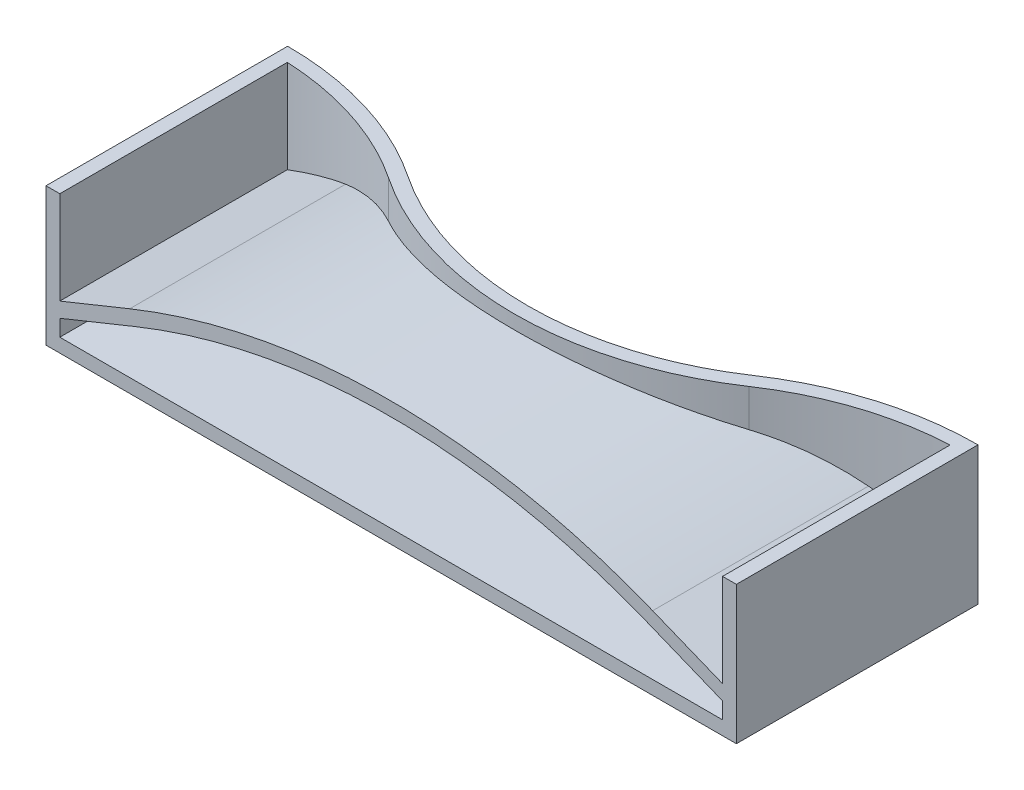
ISO-10303-21;
HEADER;
FILE_DESCRIPTION(('STEP AP214'),'2;1');
FILE_NAME('part.step','',(''),(''),'','','');
FILE_SCHEMA(('AUTOMOTIVE_DESIGN { 1 0 10303 214 1 1 1 1 }'));
ENDSEC;
DATA;
#1=APPLICATION_CONTEXT('core data for automotive mechanical design processes');
#2=APPLICATION_PROTOCOL_DEFINITION('international standard','automotive_design',2000,#1);
#3=PRODUCT_CONTEXT('',#1,'mechanical');
#4=PRODUCT('Part','Part','',(#3));
#5=PRODUCT_RELATED_PRODUCT_CATEGORY('part','',(#4));
#6=PRODUCT_DEFINITION_FORMATION('','',#4);
#7=PRODUCT_DEFINITION_CONTEXT('part definition',#1,'design');
#8=PRODUCT_DEFINITION('design','',#6,#7);
#9=PRODUCT_DEFINITION_SHAPE('','',#8);
#10=(LENGTH_UNIT() NAMED_UNIT(*) SI_UNIT(.MILLI.,.METRE.));
#11=(NAMED_UNIT(*) PLANE_ANGLE_UNIT() SI_UNIT($,.RADIAN.));
#12=(NAMED_UNIT(*) SI_UNIT($,.STERADIAN.) SOLID_ANGLE_UNIT());
#13=UNCERTAINTY_MEASURE_WITH_UNIT(LENGTH_MEASURE(1.E-05),#10,'distance_accuracy_value','');
#14=(GEOMETRIC_REPRESENTATION_CONTEXT(3) GLOBAL_UNCERTAINTY_ASSIGNED_CONTEXT((#13)) GLOBAL_UNIT_ASSIGNED_CONTEXT((#10,
#11,#12)) REPRESENTATION_CONTEXT('',''));
#15=CARTESIAN_POINT('',(0.,0.,0.));
#16=DIRECTION('',(0.,0.,1.));
#17=DIRECTION('',(1.,0.,0.));
#18=AXIS2_PLACEMENT_3D('',#15,#16,#17);
#19=CARTESIAN_POINT('',(98.,20.,-35.));
#20=DIRECTION('',(-1.,0.,0.));
#21=DIRECTION('',(0.,0.,1.));
#22=AXIS2_PLACEMENT_3D('',#19,#20,#21);
#23=PLANE('',#22);
#24=DIRECTION('',(0.,-1.,0.));
#25=VECTOR('',#24,1.);
#26=CARTESIAN_POINT('',(98.,20.,0.));
#27=LINE('',#26,#25);
#28=CARTESIAN_POINT('',(98.,4.37630217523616,0.));
#29=VERTEX_POINT('',#28);
#30=CARTESIAN_POINT('',(98.,2.,0.));
#31=VERTEX_POINT('',#30);
#32=EDGE_CURVE('E50',#29,#31,#27,.T.);
#33=ORIENTED_EDGE('',*,*,#32,.F.);
#34=DIRECTION('',(0.,0.,-1.));
#35=VECTOR('',#34,1.);
#36=CARTESIAN_POINT('',(98.,4.37630217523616,-35.));
#37=LINE('',#36,#35);
#38=CARTESIAN_POINT('',(98.,4.37630217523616,-32.9534631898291));
#39=VERTEX_POINT('',#38);
#40=EDGE_CURVE('E200',#29,#39,#37,.T.);
#41=ORIENTED_EDGE('',*,*,#40,.T.);
#42=DIRECTION('',(0.,-1.,0.));
#43=VECTOR('',#42,1.);
#44=CARTESIAN_POINT('',(98.,20.,-32.9534631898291));
#45=LINE('',#44,#43);
#46=CARTESIAN_POINT('',(98.,2.,-32.9534631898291));
#47=VERTEX_POINT('',#46);
#48=EDGE_CURVE('E486',#39,#47,#45,.T.);
#49=ORIENTED_EDGE('',*,*,#48,.T.);
#50=DIRECTION('',(0.,0.,-1.));
#51=VECTOR('',#50,1.);
#52=CARTESIAN_POINT('',(98.,2.,9.99999999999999));
#53=LINE('',#52,#51);
#54=EDGE_CURVE('E425',#31,#47,#53,.T.);
#55=ORIENTED_EDGE('',*,*,#54,.F.);
#56=EDGE_LOOP('',(#33,#41,#49,#55));
#57=FACE_BOUND('',#56,.T.);
#58=ADVANCED_FACE('F33',(#57),#23,.T.);
#59=CARTESIAN_POINT('',(100.,20.,9.99999999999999));
#60=DIRECTION('',(0.,-1.,0.));
#61=DIRECTION('',(0.,0.,-1.));
#62=AXIS2_PLACEMENT_3D('',#59,#60,#61);
#63=CYLINDRICAL_SURFACE('',#62,43.);
#64=CARTESIAN_POINT('',(100.,3.56726234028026,9.99999999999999));
#65=DIRECTION('',(0.375,0.927024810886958,0.));
#66=DIRECTION('',(0.927024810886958,-0.375,0.));
#67=AXIS2_PLACEMENT_3D('',#64,#65,#66);
#68=ELLIPSE('',#67,46.3849505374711,43.);
#69=CARTESIAN_POINT('',(87.125,8.77545627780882,-31.0272394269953));
#70=VERTEX_POINT('',#69);
#71=EDGE_CURVE('E42',#39,#70,#68,.T.);
#72=ORIENTED_EDGE('',*,*,#71,.T.);
#73=CARTESIAN_POINT('',(87.125,8.77545627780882,-31.0272394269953));
#74=CARTESIAN_POINT('',(86.6482384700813,8.96831904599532,-30.8776235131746));
#75=CARTESIAN_POINT('',(86.1724190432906,9.15646973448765,-30.7191729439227));
#76=CARTESIAN_POINT('',(85.2234017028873,9.52335260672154,-30.3844701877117));
#77=CARTESIAN_POINT('',(84.750203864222,9.70208452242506,-30.2082174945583));
#78=CARTESIAN_POINT('',(83.3414641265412,10.2220132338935,-29.654839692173));
#79=CARTESIAN_POINT('',(82.4109185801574,10.5493044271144,-29.251264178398));
#80=CARTESIAN_POINT('',(81.0311686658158,11.0122469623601,-28.5933096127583));
#81=CARTESIAN_POINT('',(80.573880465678,11.161910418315,-28.3651981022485));
#82=CARTESIAN_POINT('',(79.6654221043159,11.4520509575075,-27.8915192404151));
#83=CARTESIAN_POINT('',(79.2142519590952,11.5925280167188,-27.6459518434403));
#84=CARTESIAN_POINT('',(78.3162989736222,11.8652132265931,-27.1360373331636));
#85=CARTESIAN_POINT('',(77.8695583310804,11.9973670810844,-26.8715869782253));
#86=CARTESIAN_POINT('',(76.9840967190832,12.2526697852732,-26.3254589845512));
#87=CARTESIAN_POINT('',(76.5453758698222,12.3758185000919,-26.0437810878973));
#88=CARTESIAN_POINT('',(76.1111111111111,12.4945541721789,-25.7536150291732));
#89=B_SPLINE_CURVE_WITH_KNOTS('',3,(#73,#74,#75,#76,#77,#78,#79,#80,#81,#82,#83,#84,#85,#86,#87,
#88),.UNSPECIFIED.,.F.,.F.,(4,2,2,2,2,2,2,4),(0.,1.60660878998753,3.21326327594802,
6.40689480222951,8.00406348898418,9.60123635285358,11.2079321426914,12.8146519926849),.UNSPECIFIED.);
#90=CARTESIAN_POINT('',(76.1111111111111,12.4945541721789,-25.7536150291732));
#91=VERTEX_POINT('',#90);
#92=EDGE_CURVE('E193',#70,#91,#89,.T.);
#93=ORIENTED_EDGE('',*,*,#92,.T.);
#94=DIRECTION('',(0.,-1.,0.));
#95=VECTOR('',#94,1.);
#96=CARTESIAN_POINT('',(76.1111111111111,20.,-25.7536150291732));
#97=LINE('',#96,#95);
#98=CARTESIAN_POINT('',(76.1111111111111,2.,-25.7536150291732));
#99=VERTEX_POINT('',#98);
#100=EDGE_CURVE('E283',#91,#99,#97,.T.);
#101=ORIENTED_EDGE('',*,*,#100,.T.);
#102=CARTESIAN_POINT('',(100.,2.,9.99999999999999));
#103=DIRECTION('',(0.,-1.,0.));
#104=DIRECTION('',(0.,0.,-1.));
#105=AXIS2_PLACEMENT_3D('',#102,#103,#104);
#106=CIRCLE('',#105,43.);
#107=EDGE_CURVE('E481',#47,#99,#106,.F.);
#108=ORIENTED_EDGE('',*,*,#107,.F.);
#109=ORIENTED_EDGE('',*,*,#48,.F.);
#110=EDGE_LOOP('',(#72,#93,#101,#108,#109));
#111=FACE_BOUND('',#110,.T.);
#112=ADVANCED_FACE('F281',(#111),#63,.F.);
#113=CARTESIAN_POINT('',(50.,20.,-64.8331477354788));
#114=DIRECTION('',(0.,-1.,0.));
#115=DIRECTION('',(0.,0.,-1.));
#116=AXIS2_PLACEMENT_3D('',#113,#114,#115);
#117=CYLINDRICAL_SURFACE('',#116,47.);
#118=ORIENTED_EDGE('',*,*,#100,.F.);
#119=CARTESIAN_POINT('',(76.1111111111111,12.4945541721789,-25.7536150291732));
#120=CARTESIAN_POINT('',(75.5986373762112,12.6346820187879,-25.4112083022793));
#121=CARTESIAN_POINT('',(75.0790136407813,12.772326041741,-25.0785986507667));
#122=CARTESIAN_POINT('',(74.0259658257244,13.0419095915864,-24.433464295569));
#123=CARTESIAN_POINT('',(73.4925410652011,13.1738488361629,-24.1209405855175));
#124=CARTESIAN_POINT('',(71.8721809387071,13.5600338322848,-23.2141659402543));
#125=CARTESIAN_POINT('',(70.7653603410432,13.8045915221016,-22.6508456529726));
#126=CARTESIAN_POINT('',(68.5026064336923,14.2624762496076,-21.6103750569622));
#127=CARTESIAN_POINT('',(67.3465662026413,14.4757302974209,-21.1334255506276));
#128=CARTESIAN_POINT('',(64.994665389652,14.8651121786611,-20.27163981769));
#129=CARTESIAN_POINT('',(63.7988105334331,15.0412453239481,-19.8867904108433));
#130=CARTESIAN_POINT('',(61.3714352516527,15.3523868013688,-19.2120785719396));
#131=CARTESIAN_POINT('',(60.1398195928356,15.4872716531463,-18.9225011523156));
#132=CARTESIAN_POINT('',(57.6531362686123,15.7116399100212,-18.4431403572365));
#133=CARTESIAN_POINT('',(56.3980675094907,15.8011211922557,-18.2533616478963));
#134=CARTESIAN_POINT('',(53.8764723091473,15.932117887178,-17.9761432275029));
#135=CARTESIAN_POINT('',(52.6099706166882,15.9737195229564,-17.8885195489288));
#136=CARTESIAN_POINT('',(50.073421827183,16.0080963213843,-17.8160847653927));
#137=CARTESIAN_POINT('',(48.8033749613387,16.0008745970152,-17.831267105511));
#138=CARTESIAN_POINT('',(46.3326513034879,15.9393831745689,-17.9609335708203));
#139=CARTESIAN_POINT('',(45.1316519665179,15.8874594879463,-18.0704662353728));
#140=CARTESIAN_POINT('',(42.7441625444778,15.7409902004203,-18.3810014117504));
#141=CARTESIAN_POINT('',(41.5576725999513,15.6464441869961,-18.5820048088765));
#142=CARTESIAN_POINT('',(39.2060101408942,15.4169062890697,-19.0736168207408));
#143=CARTESIAN_POINT('',(38.0408638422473,15.281867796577,-19.3643287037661));
#144=CARTESIAN_POINT('',(35.7408502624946,14.9746008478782,-20.0323623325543));
#145=CARTESIAN_POINT('',(34.6059789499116,14.8023773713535,-20.4096724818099));
#146=CARTESIAN_POINT('',(32.6387461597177,14.4696482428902,-21.1477581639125));
#147=CARTESIAN_POINT('',(31.7986110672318,14.3160914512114,-21.4911377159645));
#148=CARTESIAN_POINT('',(30.1424533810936,13.9916989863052,-22.2244892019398));
#149=CARTESIAN_POINT('',(29.3264278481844,13.8208654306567,-22.6144554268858));
#150=CARTESIAN_POINT('',(27.7235059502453,13.4646534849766,-23.4378949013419));
#151=CARTESIAN_POINT('',(26.9365218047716,13.2793253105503,-23.8712192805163));
#152=CARTESIAN_POINT('',(25.3909144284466,12.8959245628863,-24.780715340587));
#153=CARTESIAN_POINT('',(24.6322912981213,12.6978519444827,-25.2568871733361));
#154=CARTESIAN_POINT('',(23.8888888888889,12.4945541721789,-25.7536150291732));
#155=B_SPLINE_CURVE_WITH_KNOTS('',3,(#119,#120,#121,#122,#123,#124,#125,#126,#127,#128,#129,
#130,#131,#132,#133,#134,#135,#136,#137,#138,#139,#140,#141,#142,#143,#144,#145,#146,#147,#148,
#149,#150,#151,#152,#153,#154),.UNSPECIFIED.,.F.,.F.,(4,2,2,2,2,2,2,2,2,2,2,2,2,2,2,2,2,4),(0.,
1.89594912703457,3.79199197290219,7.58481833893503,11.3863524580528,15.1873422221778,
18.9996016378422,22.8120392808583,26.6176005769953,30.422919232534,34.0399190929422,
37.6569539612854,41.2781682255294,44.8988978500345,47.6588077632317,50.4183798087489,
53.1687823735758,55.9191946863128),.UNSPECIFIED.);
#156=CARTESIAN_POINT('',(23.8888888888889,12.4945541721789,-25.7536150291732));
#157=VERTEX_POINT('',#156);
#158=EDGE_CURVE('E232',#91,#157,#155,.T.);
#159=ORIENTED_EDGE('',*,*,#158,.T.);
#160=DIRECTION('',(0.,-1.,0.));
#161=VECTOR('',#160,1.);
#162=CARTESIAN_POINT('',(23.8888888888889,20.,-25.7536150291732));
#163=LINE('',#162,#161);
#164=CARTESIAN_POINT('',(23.8888888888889,2.,-25.7536150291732));
#165=VERTEX_POINT('',#164);
#166=EDGE_CURVE('E390',#157,#165,#163,.T.);
#167=ORIENTED_EDGE('',*,*,#166,.T.);
#168=CARTESIAN_POINT('',(50.,2.,-64.8331477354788));
#169=DIRECTION('',(0.,-1.,0.));
#170=DIRECTION('',(0.,0.,-1.));
#171=AXIS2_PLACEMENT_3D('',#168,#169,#170);
#172=CIRCLE('',#171,47.);
#173=EDGE_CURVE('E291',#99,#165,#172,.T.);
#174=ORIENTED_EDGE('',*,*,#173,.F.);
#175=EDGE_LOOP('',(#118,#159,#167,#174));
#176=FACE_BOUND('',#175,.T.);
#177=ADVANCED_FACE('F288',(#176),#117,.T.);
#178=CARTESIAN_POINT('',(0.,20.,9.99999999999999));
#179=DIRECTION('',(0.,-1.,0.));
#180=DIRECTION('',(0.,0.,-1.));
#181=AXIS2_PLACEMENT_3D('',#178,#179,#180);
#182=CYLINDRICAL_SURFACE('',#181,43.);
#183=DIRECTION('',(0.,-1.,0.));
#184=VECTOR('',#183,1.);
#185=CARTESIAN_POINT('',(2.,20.,-32.9534631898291));
#186=LINE('',#185,#184);
#187=CARTESIAN_POINT('',(2.,20.,-32.9534631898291));
#188=VERTEX_POINT('',#187);
#189=CARTESIAN_POINT('',(2.,6.53374173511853,-32.9534631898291));
#190=VERTEX_POINT('',#189);
#191=EDGE_CURVE('E384',#188,#190,#186,.T.);
#192=ORIENTED_EDGE('',*,*,#191,.T.);
#193=CARTESIAN_POINT('',(0.,5.72470190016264,9.99999999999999));
#194=DIRECTION('',(0.375,-0.927024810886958,0.));
#195=DIRECTION('',(-0.927024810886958,-0.375,0.));
#196=AXIS2_PLACEMENT_3D('',#193,#194,#195);
#197=ELLIPSE('',#196,46.384950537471,43.);
#198=CARTESIAN_POINT('',(12.125,10.6295058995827,-31.255113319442));
#199=VERTEX_POINT('',#198);
#200=EDGE_CURVE('E230',#190,#199,#197,.T.);
#201=ORIENTED_EDGE('',*,*,#200,.T.);
#202=CARTESIAN_POINT('',(23.8888888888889,14.5664382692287,-25.7536150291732));
#203=CARTESIAN_POINT('',(23.4263552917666,14.4426606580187,-26.0626730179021));
#204=CARTESIAN_POINT('',(22.9587209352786,14.3139787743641,-26.3621275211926));
#205=CARTESIAN_POINT('',(22.0143270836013,14.0465999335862,-26.941521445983));
#206=CARTESIAN_POINT('',(21.5375677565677,13.9079031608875,-27.2214612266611));
#207=CARTESIAN_POINT('',(20.5791836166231,13.6212407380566,-27.7597315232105));
#208=CARTESIAN_POINT('',(20.0976123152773,13.4733429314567,-28.0181934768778));
#209=CARTESIAN_POINT('',(19.1275755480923,13.1673127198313,-28.5153588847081));
#210=CARTESIAN_POINT('',(18.6391101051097,13.0091803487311,-28.7540624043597));
#211=CARTESIAN_POINT('',(17.6563767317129,12.6825904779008,-29.2115558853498));
#212=CARTESIAN_POINT('',(17.1621091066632,12.5141335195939,-29.4303468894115));
#213=CARTESIAN_POINT('',(16.1688028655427,12.1668374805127,-29.8479622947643));
#214=CARTESIAN_POINT('',(15.6697641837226,11.9879982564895,-30.0467864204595));
#215=CARTESIAN_POINT('',(14.6646130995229,11.6187026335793,-30.4257279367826));
#216=CARTESIAN_POINT('',(14.1584757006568,11.4281763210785,-30.6057108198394));
#217=CARTESIAN_POINT('',(13.1435035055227,11.0366686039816,-30.94551192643));
#218=CARTESIAN_POINT('',(12.6346688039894,10.8356875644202,-31.1053308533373));
#219=CARTESIAN_POINT('',(12.125,10.6295058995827,-31.255113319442));
#220=B_SPLINE_CURVE_WITH_KNOTS('',3,(#202,#203,#204,#205,#206,#207,#208,#209,#210,#211,#212,
#213,#214,#215,#216,#217,#218,#219),.UNSPECIFIED.,.F.,.F.,(4,2,2,2,2,2,2,2,4),(0.,
1.70954274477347,3.41905401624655,5.11718596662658,6.81531228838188,8.51334963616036,
10.2114104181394,11.9208678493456,13.6302656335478),.UNSPECIFIED.);
#221=CARTESIAN_POINT('',(23.8888888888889,14.5664382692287,-25.7536150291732));
#222=VERTEX_POINT('',#221);
#223=EDGE_CURVE('E298',#222,#199,#220,.T.);
#224=ORIENTED_EDGE('',*,*,#223,.F.);
#225=CARTESIAN_POINT('',(23.8888888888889,20.,-25.7536150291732));
#226=VERTEX_POINT('',#225);
#227=EDGE_CURVE('E293',#226,#222,#163,.T.);
#228=ORIENTED_EDGE('',*,*,#227,.F.);
#229=CARTESIAN_POINT('',(0.,20.,9.99999999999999));
#230=DIRECTION('',(0.,-1.,0.));
#231=DIRECTION('',(0.,0.,-1.));
#232=AXIS2_PLACEMENT_3D('',#229,#230,#231);
#233=CIRCLE('',#232,43.);
#234=EDGE_CURVE('E388',#226,#188,#233,.F.);
#235=ORIENTED_EDGE('',*,*,#234,.T.);
#236=EDGE_LOOP('',(#192,#201,#224,#228,#235));
#237=FACE_BOUND('',#236,.T.);
#238=ADVANCED_FACE('F316',(#237),#182,.F.);
#239=CARTESIAN_POINT('',(2.,20.,0.));
#240=DIRECTION('',(1.,0.,0.));
#241=DIRECTION('',(0.,0.,-1.));
#242=AXIS2_PLACEMENT_3D('',#239,#240,#241);
#243=PLANE('',#242);
#244=DIRECTION('',(0.,-1.,0.));
#245=VECTOR('',#244,1.);
#246=CARTESIAN_POINT('',(2.,20.,0.));
#247=LINE('',#246,#245);
#248=CARTESIAN_POINT('',(2.,20.,0.));
#249=VERTEX_POINT('',#248);
#250=CARTESIAN_POINT('',(2.,6.53374173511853,0.));
#251=VERTEX_POINT('',#250);
#252=EDGE_CURVE('E420',#249,#251,#247,.T.);
#253=ORIENTED_EDGE('',*,*,#252,.T.);
#254=DIRECTION('',(0.,0.,-1.));
#255=VECTOR('',#254,1.);
#256=CARTESIAN_POINT('',(2.,6.53374173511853,0.));
#257=LINE('',#256,#255);
#258=EDGE_CURVE('E299',#251,#190,#257,.T.);
#259=ORIENTED_EDGE('',*,*,#258,.T.);
#260=ORIENTED_EDGE('',*,*,#191,.F.);
#261=DIRECTION('',(0.,0.,1.));
#262=VECTOR('',#261,1.);
#263=CARTESIAN_POINT('',(2.,20.,9.99999999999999));
#264=LINE('',#263,#262);
#265=EDGE_CURVE('E417',#188,#249,#264,.T.);
#266=ORIENTED_EDGE('',*,*,#265,.T.);
#267=EDGE_LOOP('',(#253,#259,#260,#266));
#268=FACE_BOUND('',#267,.T.);
#269=ADVANCED_FACE('F354',(#268),#243,.T.);
#270=CARTESIAN_POINT('',(0.,20.,9.99999999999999));
#271=DIRECTION('',(0.,-1.,0.));
#272=DIRECTION('',(0.,0.,-1.));
#273=AXIS2_PLACEMENT_3D('',#270,#271,#272);
#274=PLANE('',#273);
#275=DIRECTION('',(0.,0.,-1.));
#276=VECTOR('',#275,1.);
#277=CARTESIAN_POINT('',(98.,20.,9.99999999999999));
#278=LINE('',#277,#276);
#279=CARTESIAN_POINT('',(98.,20.,0.));
#280=VERTEX_POINT('',#279);
#281=CARTESIAN_POINT('',(98.,20.,-32.9534631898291));
#282=VERTEX_POINT('',#281);
#283=EDGE_CURVE('E411',#280,#282,#278,.T.);
#284=ORIENTED_EDGE('',*,*,#283,.F.);
#285=DIRECTION('',(1.,0.,0.));
#286=VECTOR('',#285,1.);
#287=CARTESIAN_POINT('',(100.,20.,0.));
#288=LINE('',#287,#286);
#289=CARTESIAN_POINT('',(100.,20.,0.));
#290=VERTEX_POINT('',#289);
#291=EDGE_CURVE('E446',#280,#290,#288,.T.);
#292=ORIENTED_EDGE('',*,*,#291,.T.);
#293=DIRECTION('',(0.,0.,-1.));
#294=VECTOR('',#293,1.);
#295=CARTESIAN_POINT('',(100.,20.,-35.));
#296=LINE('',#295,#294);
#297=CARTESIAN_POINT('',(100.,20.,-35.));
#298=VERTEX_POINT('',#297);
#299=EDGE_CURVE('E450',#290,#298,#296,.T.);
#300=ORIENTED_EDGE('',*,*,#299,.T.);
#301=CARTESIAN_POINT('',(100.,20.,9.99999999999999));
#302=DIRECTION('',(0.,1.,0.));
#303=DIRECTION('',(0.,0.,-1.));
#304=AXIS2_PLACEMENT_3D('',#301,#302,#303);
#305=CIRCLE('',#304,45.);
#306=CARTESIAN_POINT('',(75.,20.,-27.4165738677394));
#307=VERTEX_POINT('',#306);
#308=EDGE_CURVE('E452',#298,#307,#305,.T.);
#309=ORIENTED_EDGE('',*,*,#308,.T.);
#310=CARTESIAN_POINT('',(50.,20.,-64.8331477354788));
#311=DIRECTION('',(0.,-1.,0.));
#312=DIRECTION('',(0.,0.,1.));
#313=AXIS2_PLACEMENT_3D('',#310,#311,#312);
#314=CIRCLE('',#313,45.);
#315=CARTESIAN_POINT('',(25.,20.,-27.4165738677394));
#316=VERTEX_POINT('',#315);
#317=EDGE_CURVE('E454',#307,#316,#314,.T.);
#318=ORIENTED_EDGE('',*,*,#317,.T.);
#319=CARTESIAN_POINT('',(0.,20.,9.99999999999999));
#320=DIRECTION('',(0.,1.,0.));
#321=DIRECTION('',(0.,0.,-1.));
#322=AXIS2_PLACEMENT_3D('',#319,#320,#321);
#323=CIRCLE('',#322,45.);
#324=CARTESIAN_POINT('',(0.,20.,-35.));
#325=VERTEX_POINT('',#324);
#326=EDGE_CURVE('E456',#316,#325,#323,.T.);
#327=ORIENTED_EDGE('',*,*,#326,.T.);
#328=DIRECTION('',(0.,0.,1.));
#329=VECTOR('',#328,1.);
#330=CARTESIAN_POINT('',(0.,20.,0.));
#331=LINE('',#330,#329);
#332=CARTESIAN_POINT('',(0.,20.,0.));
#333=VERTEX_POINT('',#332);
#334=EDGE_CURVE('E458',#325,#333,#331,.T.);
#335=ORIENTED_EDGE('',*,*,#334,.T.);
#336=EDGE_CURVE('E447',#333,#249,#288,.T.);
#337=ORIENTED_EDGE('',*,*,#336,.T.);
#338=ORIENTED_EDGE('',*,*,#265,.F.);
#339=ORIENTED_EDGE('',*,*,#234,.F.);
#340=CARTESIAN_POINT('',(50.,20.,-64.8331477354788));
#341=DIRECTION('',(0.,-1.,0.));
#342=DIRECTION('',(0.,0.,-1.));
#343=AXIS2_PLACEMENT_3D('',#340,#341,#342);
#344=CIRCLE('',#343,47.);
#345=CARTESIAN_POINT('',(76.1111111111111,20.,-25.7536150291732));
#346=VERTEX_POINT('',#345);
#347=EDGE_CURVE('E401',#346,#226,#344,.T.);
#348=ORIENTED_EDGE('',*,*,#347,.F.);
#349=CARTESIAN_POINT('',(100.,20.,9.99999999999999));
#350=DIRECTION('',(0.,-1.,0.));
#351=DIRECTION('',(0.,0.,-1.));
#352=AXIS2_PLACEMENT_3D('',#349,#350,#351);
#353=CIRCLE('',#352,43.);
#354=EDGE_CURVE('E413',#282,#346,#353,.F.);
#355=ORIENTED_EDGE('',*,*,#354,.F.);
#356=EDGE_LOOP('',(#284,#292,#300,#309,#318,#327,#335,#337,#338,#339,#348,#355));
#357=FACE_BOUND('',#356,.T.);
#358=ADVANCED_FACE('F343',(#357),#274,.F.);
#359=CARTESIAN_POINT('',(100.,20.,0.));
#360=DIRECTION('',(0.,0.,-1.));
#361=DIRECTION('',(-1.,0.,0.));
#362=AXIS2_PLACEMENT_3D('',#359,#360,#361);
#363=PLANE('',#362);
#364=CARTESIAN_POINT('',(98.,6.53374173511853,0.));
#365=VERTEX_POINT('',#364);
#366=EDGE_CURVE('E426',#280,#365,#27,.T.);
#367=ORIENTED_EDGE('',*,*,#366,.T.);
#368=DIRECTION('',(-0.927024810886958,0.375,0.));
#369=VECTOR('',#368,1.);
#370=CARTESIAN_POINT('',(87.875,10.6295058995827,0.));
#371=LINE('',#370,#369);
#372=CARTESIAN_POINT('',(87.875,10.6295058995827,0.));
#373=VERTEX_POINT('',#372);
#374=EDGE_CURVE('E212',#373,#365,#371,.F.);
#375=ORIENTED_EDGE('',*,*,#374,.F.);
#376=CARTESIAN_POINT('',(50.,-83.,0.));
#377=DIRECTION('',(0.,0.,-1.));
#378=DIRECTION('',(-1.,0.,0.));
#379=AXIS2_PLACEMENT_3D('',#376,#377,#378);
#380=CIRCLE('',#379,101.);
#381=CARTESIAN_POINT('',(12.125,10.6295058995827,0.));
#382=VERTEX_POINT('',#381);
#383=EDGE_CURVE('E222',#382,#373,#380,.T.);
#384=ORIENTED_EDGE('',*,*,#383,.F.);
#385=DIRECTION('',(0.927024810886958,0.375,0.));
#386=VECTOR('',#385,1.);
#387=CARTESIAN_POINT('',(12.125,10.6295058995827,0.));
#388=LINE('',#387,#386);
#389=EDGE_CURVE('E218',#382,#251,#388,.F.);
#390=ORIENTED_EDGE('',*,*,#389,.T.);
#391=ORIENTED_EDGE('',*,*,#252,.F.);
#392=ORIENTED_EDGE('',*,*,#336,.F.);
#393=DIRECTION('',(0.,-1.,0.));
#394=VECTOR('',#393,1.);
#395=CARTESIAN_POINT('',(0.,20.,0.));
#396=LINE('',#395,#394);
#397=CARTESIAN_POINT('',(0.,0.,0.));
#398=VERTEX_POINT('',#397);
#399=EDGE_CURVE('E460',#333,#398,#396,.T.);
#400=ORIENTED_EDGE('',*,*,#399,.T.);
#401=DIRECTION('',(1.,0.,0.));
#402=VECTOR('',#401,1.);
#403=CARTESIAN_POINT('',(100.,0.,0.));
#404=LINE('',#403,#402);
#405=CARTESIAN_POINT('',(100.,0.,0.));
#406=VERTEX_POINT('',#405);
#407=EDGE_CURVE('E428',#398,#406,#404,.T.);
#408=ORIENTED_EDGE('',*,*,#407,.T.);
#409=DIRECTION('',(0.,-1.,0.));
#410=VECTOR('',#409,1.);
#411=CARTESIAN_POINT('',(100.,20.,0.));
#412=LINE('',#411,#410);
#413=EDGE_CURVE('E470',#290,#406,#412,.T.);
#414=ORIENTED_EDGE('',*,*,#413,.F.);
#415=ORIENTED_EDGE('',*,*,#291,.F.);
#416=EDGE_LOOP('',(#367,#375,#384,#390,#391,#392,#400,#408,#414,#415));
#417=FACE_BOUND('',#416,.T.);
#418=DIRECTION('',(-0.927024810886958,0.375,0.));
#419=VECTOR('',#418,1.);
#420=CARTESIAN_POINT('',(87.125,8.77545627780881,0.));
#421=LINE('',#420,#419);
#422=CARTESIAN_POINT('',(87.125,8.77545627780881,0.));
#423=VERTEX_POINT('',#422);
#424=EDGE_CURVE('E196',#423,#29,#421,.F.);
#425=ORIENTED_EDGE('',*,*,#424,.T.);
#426=ORIENTED_EDGE('',*,*,#32,.T.);
#427=DIRECTION('',(1.,0.,0.));
#428=VECTOR('',#427,1.);
#429=CARTESIAN_POINT('',(0.,2.,0.));
#430=LINE('',#429,#428);
#431=CARTESIAN_POINT('',(2.,2.,0.));
#432=VERTEX_POINT('',#431);
#433=EDGE_CURVE('E422',#432,#31,#430,.T.);
#434=ORIENTED_EDGE('',*,*,#433,.F.);
#435=CARTESIAN_POINT('',(2.,4.37630217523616,0.));
#436=VERTEX_POINT('',#435);
#437=EDGE_CURVE('E419',#436,#432,#247,.T.);
#438=ORIENTED_EDGE('',*,*,#437,.F.);
#439=DIRECTION('',(0.927024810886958,0.375,0.));
#440=VECTOR('',#439,1.);
#441=CARTESIAN_POINT('',(12.875,8.77545627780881,0.));
#442=LINE('',#441,#440);
#443=CARTESIAN_POINT('',(12.875,8.77545627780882,0.));
#444=VERTEX_POINT('',#443);
#445=EDGE_CURVE('E208',#444,#436,#442,.F.);
#446=ORIENTED_EDGE('',*,*,#445,.F.);
#447=CARTESIAN_POINT('',(50.,-83.,0.));
#448=DIRECTION('',(0.,0.,-1.));
#449=DIRECTION('',(-1.,0.,0.));
#450=AXIS2_PLACEMENT_3D('',#447,#448,#449);
#451=CIRCLE('',#450,99.);
#452=EDGE_CURVE('E191',#444,#423,#451,.T.);
#453=ORIENTED_EDGE('',*,*,#452,.T.);
#454=EDGE_LOOP('',(#425,#426,#434,#438,#446,#453));
#455=FACE_BOUND('',#454,.T.);
#456=ADVANCED_FACE('F205',(#417,#455),#363,.F.);
#457=CARTESIAN_POINT('',(100.,20.,-35.));
#458=DIRECTION('',(-1.,0.,0.));
#459=DIRECTION('',(0.,0.,1.));
#460=AXIS2_PLACEMENT_3D('',#457,#458,#459);
#461=PLANE('',#460);
#462=ORIENTED_EDGE('',*,*,#413,.T.);
#463=DIRECTION('',(0.,0.,-1.));
#464=VECTOR('',#463,1.);
#465=CARTESIAN_POINT('',(100.,0.,-35.));
#466=LINE('',#465,#464);
#467=CARTESIAN_POINT('',(100.,0.,-35.));
#468=VERTEX_POINT('',#467);
#469=EDGE_CURVE('E431',#406,#468,#466,.T.);
#470=ORIENTED_EDGE('',*,*,#469,.T.);
#471=DIRECTION('',(0.,-1.,0.));
#472=VECTOR('',#471,1.);
#473=CARTESIAN_POINT('',(100.,20.,-35.));
#474=LINE('',#473,#472);
#475=EDGE_CURVE('E468',#298,#468,#474,.T.);
#476=ORIENTED_EDGE('',*,*,#475,.F.);
#477=ORIENTED_EDGE('',*,*,#299,.F.);
#478=EDGE_LOOP('',(#462,#470,#476,#477));
#479=FACE_BOUND('',#478,.T.);
#480=ADVANCED_FACE('F339',(#479),#461,.F.);
#481=CARTESIAN_POINT('',(100.,20.,9.99999999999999));
#482=DIRECTION('',(0.,-1.,0.));
#483=DIRECTION('',(0.,0.,-1.));
#484=AXIS2_PLACEMENT_3D('',#481,#482,#483);
#485=CYLINDRICAL_SURFACE('',#484,45.);
#486=CARTESIAN_POINT('',(100.,0.,9.99999999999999));
#487=DIRECTION('',(0.,1.,0.));
#488=DIRECTION('',(0.,0.,-1.));
#489=AXIS2_PLACEMENT_3D('',#486,#487,#488);
#490=CIRCLE('',#489,45.);
#491=CARTESIAN_POINT('',(75.,0.,-27.4165738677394));
#492=VERTEX_POINT('',#491);
#493=EDGE_CURVE('E434',#468,#492,#490,.T.);
#494=ORIENTED_EDGE('',*,*,#493,.T.);
#495=DIRECTION('',(0.,-1.,0.));
#496=VECTOR('',#495,1.);
#497=CARTESIAN_POINT('',(75.,20.,-27.4165738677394));
#498=LINE('',#497,#496);
#499=EDGE_CURVE('E466',#307,#492,#498,.T.);
#500=ORIENTED_EDGE('',*,*,#499,.F.);
#501=ORIENTED_EDGE('',*,*,#308,.F.);
#502=ORIENTED_EDGE('',*,*,#475,.T.);
#503=EDGE_LOOP('',(#494,#500,#501,#502));
#504=FACE_BOUND('',#503,.T.);
#505=ADVANCED_FACE('F335',(#504),#485,.T.);
#506=CARTESIAN_POINT('',(50.,20.,-64.8331477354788));
#507=DIRECTION('',(0.,-1.,0.));
#508=DIRECTION('',(0.,0.,-1.));
#509=AXIS2_PLACEMENT_3D('',#506,#507,#508);
#510=CYLINDRICAL_SURFACE('',#509,45.);
#511=ORIENTED_EDGE('',*,*,#499,.T.);
#512=CARTESIAN_POINT('',(50.,0.,-64.8331477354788));
#513=DIRECTION('',(0.,-1.,0.));
#514=DIRECTION('',(0.,0.,1.));
#515=AXIS2_PLACEMENT_3D('',#512,#513,#514);
#516=CIRCLE('',#515,45.);
#517=CARTESIAN_POINT('',(25.,0.,-27.4165738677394));
#518=VERTEX_POINT('',#517);
#519=EDGE_CURVE('E437',#492,#518,#516,.T.);
#520=ORIENTED_EDGE('',*,*,#519,.T.);
#521=DIRECTION('',(0.,-1.,0.));
#522=VECTOR('',#521,1.);
#523=CARTESIAN_POINT('',(25.,20.,-27.4165738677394));
#524=LINE('',#523,#522);
#525=EDGE_CURVE('E464',#316,#518,#524,.T.);
#526=ORIENTED_EDGE('',*,*,#525,.F.);
#527=ORIENTED_EDGE('',*,*,#317,.F.);
#528=EDGE_LOOP('',(#511,#520,#526,#527));
#529=FACE_BOUND('',#528,.T.);
#530=ADVANCED_FACE('F331',(#529),#510,.F.);
#531=CARTESIAN_POINT('',(0.,20.,9.99999999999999));
#532=DIRECTION('',(0.,-1.,0.));
#533=DIRECTION('',(0.,0.,-1.));
#534=AXIS2_PLACEMENT_3D('',#531,#532,#533);
#535=CYLINDRICAL_SURFACE('',#534,45.);
#536=CARTESIAN_POINT('',(0.,0.,9.99999999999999));
#537=DIRECTION('',(0.,1.,0.));
#538=DIRECTION('',(0.,0.,-1.));
#539=AXIS2_PLACEMENT_3D('',#536,#537,#538);
#540=CIRCLE('',#539,45.);
#541=CARTESIAN_POINT('',(0.,0.,-35.));
#542=VERTEX_POINT('',#541);
#543=EDGE_CURVE('E440',#518,#542,#540,.T.);
#544=ORIENTED_EDGE('',*,*,#543,.T.);
#545=DIRECTION('',(0.,-1.,0.));
#546=VECTOR('',#545,1.);
#547=CARTESIAN_POINT('',(0.,20.,-35.));
#548=LINE('',#547,#546);
#549=EDGE_CURVE('E462',#325,#542,#548,.T.);
#550=ORIENTED_EDGE('',*,*,#549,.F.);
#551=ORIENTED_EDGE('',*,*,#326,.F.);
#552=ORIENTED_EDGE('',*,*,#525,.T.);
#553=EDGE_LOOP('',(#544,#550,#551,#552));
#554=FACE_BOUND('',#553,.T.);
#555=ADVANCED_FACE('F327',(#554),#535,.T.);
#556=CARTESIAN_POINT('',(0.,20.,0.));
#557=DIRECTION('',(1.,0.,0.));
#558=DIRECTION('',(0.,0.,-1.));
#559=AXIS2_PLACEMENT_3D('',#556,#557,#558);
#560=PLANE('',#559);
#561=DIRECTION('',(0.,0.,1.));
#562=VECTOR('',#561,1.);
#563=CARTESIAN_POINT('',(0.,0.,0.));
#564=LINE('',#563,#562);
#565=EDGE_CURVE('E443',#542,#398,#564,.T.);
#566=ORIENTED_EDGE('',*,*,#565,.T.);
#567=ORIENTED_EDGE('',*,*,#399,.F.);
#568=ORIENTED_EDGE('',*,*,#334,.F.);
#569=ORIENTED_EDGE('',*,*,#549,.T.);
#570=EDGE_LOOP('',(#566,#567,#568,#569));
#571=FACE_BOUND('',#570,.T.);
#572=ADVANCED_FACE('F330',(#571),#560,.F.);
#573=CARTESIAN_POINT('',(0.,0.,9.99999999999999));
#574=DIRECTION('',(0.,-1.,0.));
#575=DIRECTION('',(0.,0.,-1.));
#576=AXIS2_PLACEMENT_3D('',#573,#574,#575);
#577=PLANE('',#576);
#578=ORIENTED_EDGE('',*,*,#407,.F.);
#579=ORIENTED_EDGE('',*,*,#565,.F.);
#580=ORIENTED_EDGE('',*,*,#543,.F.);
#581=ORIENTED_EDGE('',*,*,#519,.F.);
#582=ORIENTED_EDGE('',*,*,#493,.F.);
#583=ORIENTED_EDGE('',*,*,#469,.F.);
#584=EDGE_LOOP('',(#578,#579,#580,#581,#582,#583));
#585=FACE_BOUND('',#584,.T.);
#586=ADVANCED_FACE('F350',(#585),#577,.T.);
#587=DIRECTION('',(0.,0.,-1.));
#588=VECTOR('',#587,1.);
#589=CARTESIAN_POINT('',(98.,6.53374173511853,-35.));
#590=LINE('',#589,#588);
#591=CARTESIAN_POINT('',(98.,6.53374173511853,-32.9534631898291));
#592=VERTEX_POINT('',#591);
#593=EDGE_CURVE('E58',#365,#592,#590,.T.);
#594=ORIENTED_EDGE('',*,*,#593,.F.);
#595=ORIENTED_EDGE('',*,*,#366,.F.);
#596=ORIENTED_EDGE('',*,*,#283,.T.);
#597=EDGE_CURVE('E485',#282,#592,#45,.T.);
#598=ORIENTED_EDGE('',*,*,#597,.T.);
#599=EDGE_LOOP('',(#594,#595,#596,#598));
#600=FACE_BOUND('',#599,.T.);
#601=ADVANCED_FACE('F325',(#600),#23,.T.);
#602=CARTESIAN_POINT('',(87.875,10.6295058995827,-31.255113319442));
#603=CARTESIAN_POINT('',(87.3653311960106,10.8356875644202,-31.1053308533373));
#604=CARTESIAN_POINT('',(86.8564964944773,11.0366686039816,-30.94551192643));
#605=CARTESIAN_POINT('',(85.8415242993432,11.4281763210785,-30.6057108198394));
#606=CARTESIAN_POINT('',(85.3353869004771,11.6187026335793,-30.4257279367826));
#607=CARTESIAN_POINT('',(84.3302358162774,11.9879982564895,-30.0467864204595));
#608=CARTESIAN_POINT('',(83.8311971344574,12.1668374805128,-29.8479622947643));
#609=CARTESIAN_POINT('',(82.8378908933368,12.5141335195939,-29.4303468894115));
#610=CARTESIAN_POINT('',(82.3436232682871,12.6825904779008,-29.2115558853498));
#611=CARTESIAN_POINT('',(81.3608898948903,13.0091803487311,-28.7540624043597));
#612=CARTESIAN_POINT('',(80.8724244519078,13.1673127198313,-28.5153588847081));
#613=CARTESIAN_POINT('',(79.9023876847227,13.4733429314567,-28.0181934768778));
#614=CARTESIAN_POINT('',(79.4208163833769,13.6212407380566,-27.7597315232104));
#615=CARTESIAN_POINT('',(78.4624322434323,13.9079031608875,-27.2214612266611));
#616=CARTESIAN_POINT('',(77.9856729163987,14.0465999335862,-26.941521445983));
#617=CARTESIAN_POINT('',(77.0412790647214,14.3139787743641,-26.3621275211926));
#618=CARTESIAN_POINT('',(76.5736447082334,14.4426606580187,-26.0626730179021));
#619=CARTESIAN_POINT('',(76.1111111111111,14.5664382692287,-25.7536150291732));
#620=B_SPLINE_CURVE_WITH_KNOTS('',3,(#602,#603,#604,#605,#606,#607,#608,#609,#610,#611,#612,
#613,#614,#615,#616,#617,#618,#619),.UNSPECIFIED.,.F.,.F.,(4,2,2,2,2,2,2,2,4),(0.,
1.7093977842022,3.41885521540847,5.11691599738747,6.81495334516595,8.51307966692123,
10.2112116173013,11.9207228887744,13.6302656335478),.UNSPECIFIED.);
#621=CARTESIAN_POINT('',(87.875,10.6295058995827,-31.255113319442));
#622=VERTEX_POINT('',#621);
#623=CARTESIAN_POINT('',(76.1111111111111,14.5664382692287,-25.7536150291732));
#624=VERTEX_POINT('',#623);
#625=EDGE_CURVE('E267',#622,#624,#620,.T.);
#626=ORIENTED_EDGE('',*,*,#625,.F.);
#627=CARTESIAN_POINT('',(100.,5.72470190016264,9.99999999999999));
#628=DIRECTION('',(0.375,0.927024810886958,0.));
#629=DIRECTION('',(0.927024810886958,-0.375,0.));
#630=AXIS2_PLACEMENT_3D('',#627,#628,#629);
#631=ELLIPSE('',#630,46.3849505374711,43.);
#632=EDGE_CURVE('E11',#592,#622,#631,.T.);
#633=ORIENTED_EDGE('',*,*,#632,.F.);
#634=ORIENTED_EDGE('',*,*,#597,.F.);
#635=ORIENTED_EDGE('',*,*,#354,.T.);
#636=EDGE_CURVE('E292',#346,#624,#97,.T.);
#637=ORIENTED_EDGE('',*,*,#636,.T.);
#638=EDGE_LOOP('',(#626,#633,#634,#635,#637));
#639=FACE_BOUND('',#638,.T.);
#640=ADVANCED_FACE('F321',(#639),#63,.F.);
#641=CARTESIAN_POINT('',(76.1111111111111,14.5664382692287,-25.7536150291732));
#642=CARTESIAN_POINT('',(75.5972386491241,14.7039648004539,-25.4102736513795));
#643=CARTESIAN_POINT('',(75.0761983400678,14.8390539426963,-25.0767973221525));
#644=CARTESIAN_POINT('',(74.0202936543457,15.1036276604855,-24.4300665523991));
#645=CARTESIAN_POINT('',(73.4854286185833,15.2331119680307,-24.1168130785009));
#646=CARTESIAN_POINT('',(71.8607434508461,15.6120889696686,-23.2080633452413));
#647=CARTESIAN_POINT('',(70.7510188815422,15.8520556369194,-22.6437019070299));
#648=CARTESIAN_POINT('',(68.4826163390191,16.3012231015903,-21.6017420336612));
#649=CARTESIAN_POINT('',(67.3238368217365,16.5103556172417,-21.1243356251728));
#650=CARTESIAN_POINT('',(64.9665658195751,16.8920764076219,-20.2621212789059));
#651=CARTESIAN_POINT('',(63.7680798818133,17.0646697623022,-19.8773004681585));
#652=CARTESIAN_POINT('',(61.3356956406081,17.3693604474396,-19.2031215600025));
#653=CARTESIAN_POINT('',(60.101705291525,17.5013397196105,-18.9140415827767));
#654=CARTESIAN_POINT('',(57.6104564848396,17.7206255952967,-18.436061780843));
#655=CARTESIAN_POINT('',(56.3531969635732,17.8079301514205,-18.2471665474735));
#656=CARTESIAN_POINT('',(53.827322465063,17.935364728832,-17.9720474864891));
#657=CARTESIAN_POINT('',(52.5587310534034,17.9755765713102,-17.8856455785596));
#658=CARTESIAN_POINT('',(50.0181594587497,18.0079862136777,-17.8159776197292));
#659=CARTESIAN_POINT('',(48.746179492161,18.0001870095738,-17.8327051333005));
#660=CARTESIAN_POINT('',(46.2698248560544,17.9383270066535,-17.9657925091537));
#661=CARTESIAN_POINT('',(45.0651316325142,17.8865011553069,-18.0773391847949));
#662=CARTESIAN_POINT('',(42.6704079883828,17.7408358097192,-18.3924809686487));
#663=CARTESIAN_POINT('',(41.4803777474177,17.646995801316,-18.5960772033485));
#664=CARTESIAN_POINT('',(39.1218877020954,17.4194805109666,-19.0934391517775));
#665=CARTESIAN_POINT('',(37.9534528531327,17.2857618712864,-19.3873030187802));
#666=CARTESIAN_POINT('',(35.6470769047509,16.9817291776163,-20.0622092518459));
#667=CARTESIAN_POINT('',(34.5091315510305,16.8114202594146,-20.4432393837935));
#668=CARTESIAN_POINT('',(32.5483718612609,16.4845173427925,-21.1839749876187));
#669=CARTESIAN_POINT('',(31.717433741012,16.3350082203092,-21.5255068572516));
#670=CARTESIAN_POINT('',(30.0791547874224,16.0194708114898,-22.2542393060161));
#671=CARTESIAN_POINT('',(29.2718108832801,15.8534446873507,-22.6414339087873));
#672=CARTESIAN_POINT('',(27.6855975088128,15.5074818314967,-23.4585087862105));
#673=CARTESIAN_POINT('',(26.9066435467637,15.3275923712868,-23.8882453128));
#674=CARTESIAN_POINT('',(25.376460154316,14.9556157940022,-24.7897929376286));
#675=CARTESIAN_POINT('',(24.6252312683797,14.7635284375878,-25.2616048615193));
#676=CARTESIAN_POINT('',(23.8888888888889,14.5664382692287,-25.7536150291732));
#677=B_SPLINE_CURVE_WITH_KNOTS('',3,(#641,#642,#643,#644,#645,#646,#647,#648,#649,#650,#651,
#652,#653,#654,#655,#656,#657,#658,#659,#660,#661,#662,#663,#664,#665,#666,#667,#668,#669,#670,
#671,#672,#673,#674,#675,#676),.UNSPECIFIED.,.F.,.F.,(4,2,2,2,2,2,2,2,2,2,2,2,2,2,2,2,2,4),(0.,
1.89915829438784,3.79840729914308,7.59758990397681,11.4050632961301,15.2120069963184,
19.0299145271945,22.8479970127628,26.6594358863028,30.4706369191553,34.0991904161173,
37.7277883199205,41.3603458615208,44.9923938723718,47.723104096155,50.4534573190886,
53.1748807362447,55.8963575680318),.UNSPECIFIED.);
#678=EDGE_CURVE('E272',#624,#222,#677,.T.);
#679=ORIENTED_EDGE('',*,*,#678,.F.);
#680=ORIENTED_EDGE('',*,*,#636,.F.);
#681=ORIENTED_EDGE('',*,*,#347,.T.);
#682=ORIENTED_EDGE('',*,*,#227,.T.);
#683=EDGE_LOOP('',(#679,#680,#681,#682));
#684=FACE_BOUND('',#683,.T.);
#685=ADVANCED_FACE('F315',(#684),#117,.T.);
#686=CARTESIAN_POINT('',(0.,3.56726234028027,9.99999999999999));
#687=DIRECTION('',(0.375,-0.927024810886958,0.));
#688=DIRECTION('',(-0.927024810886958,-0.375,0.));
#689=AXIS2_PLACEMENT_3D('',#686,#687,#688);
#690=ELLIPSE('',#689,46.384950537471,43.);
#691=CARTESIAN_POINT('',(2.,4.37630217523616,-32.9534631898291));
#692=VERTEX_POINT('',#691);
#693=CARTESIAN_POINT('',(12.875,8.77545627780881,-31.0272394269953));
#694=VERTEX_POINT('',#693);
#695=EDGE_CURVE('E225',#692,#694,#690,.T.);
#696=ORIENTED_EDGE('',*,*,#695,.F.);
#697=CARTESIAN_POINT('',(2.,2.,-32.9534631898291));
#698=VERTEX_POINT('',#697);
#699=EDGE_CURVE('E391',#692,#698,#186,.T.);
#700=ORIENTED_EDGE('',*,*,#699,.T.);
#701=CARTESIAN_POINT('',(0.,2.,9.99999999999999));
#702=DIRECTION('',(0.,-1.,0.));
#703=DIRECTION('',(0.,0.,-1.));
#704=AXIS2_PLACEMENT_3D('',#701,#702,#703);
#705=CIRCLE('',#704,43.);
#706=EDGE_CURVE('E405',#165,#698,#705,.F.);
#707=ORIENTED_EDGE('',*,*,#706,.F.);
#708=ORIENTED_EDGE('',*,*,#166,.F.);
#709=CARTESIAN_POINT('',(23.8888888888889,12.4945541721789,-25.7536150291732));
#710=CARTESIAN_POINT('',(23.4546241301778,12.3758185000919,-26.0437810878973));
#711=CARTESIAN_POINT('',(23.0159032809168,12.2526697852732,-26.3254589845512));
#712=CARTESIAN_POINT('',(22.1304416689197,11.9973670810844,-26.8715869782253));
#713=CARTESIAN_POINT('',(21.6837010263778,11.8652132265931,-27.1360373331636));
#714=CARTESIAN_POINT('',(20.7857480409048,11.5925280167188,-27.6459518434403));
#715=CARTESIAN_POINT('',(20.3345778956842,11.4520509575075,-27.8915192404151));
#716=CARTESIAN_POINT('',(19.426119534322,11.161910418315,-28.3651981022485));
#717=CARTESIAN_POINT('',(18.9688313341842,11.0122469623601,-28.5933096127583));
#718=CARTESIAN_POINT('',(17.5890814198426,10.5493044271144,-29.251264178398));
#719=CARTESIAN_POINT('',(16.6585358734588,10.2220132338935,-29.654839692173));
#720=CARTESIAN_POINT('',(15.249796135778,9.70208452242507,-30.2082174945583));
#721=CARTESIAN_POINT('',(14.7765982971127,9.52335260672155,-30.3844701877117));
#722=CARTESIAN_POINT('',(13.8275809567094,9.15646973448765,-30.7191729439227));
#723=CARTESIAN_POINT('',(13.3517615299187,8.96831904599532,-30.8776235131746));
#724=CARTESIAN_POINT('',(12.875,8.77545627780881,-31.0272394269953));
#725=B_SPLINE_CURVE_WITH_KNOTS('',3,(#709,#710,#711,#712,#713,#714,#715,#716,#717,#718,#719,
#720,#721,#722,#723,#724),.UNSPECIFIED.,.F.,.F.,(4,2,2,2,2,2,2,4),(0.,1.60671984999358,
3.21341563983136,4.81058850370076,6.40775719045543,9.60138871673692,11.2080432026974,
12.8146519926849),.UNSPECIFIED.);
#726=EDGE_CURVE('E296',#157,#694,#725,.T.);
#727=ORIENTED_EDGE('',*,*,#726,.T.);
#728=EDGE_LOOP('',(#696,#700,#707,#708,#727));
#729=FACE_BOUND('',#728,.T.);
#730=ADVANCED_FACE('F310',(#729),#182,.F.);
#731=DIRECTION('',(0.,0.,-1.));
#732=VECTOR('',#731,1.);
#733=CARTESIAN_POINT('',(2.,4.37630217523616,0.));
#734=LINE('',#733,#732);
#735=EDGE_CURVE('E37',#436,#692,#734,.T.);
#736=ORIENTED_EDGE('',*,*,#735,.F.);
#737=ORIENTED_EDGE('',*,*,#437,.T.);
#738=DIRECTION('',(0.,0.,1.));
#739=VECTOR('',#738,1.);
#740=CARTESIAN_POINT('',(2.,2.,9.99999999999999));
#741=LINE('',#740,#739);
#742=EDGE_CURVE('E407',#698,#432,#741,.T.);
#743=ORIENTED_EDGE('',*,*,#742,.F.);
#744=ORIENTED_EDGE('',*,*,#699,.F.);
#745=EDGE_LOOP('',(#736,#737,#743,#744));
#746=FACE_BOUND('',#745,.T.);
#747=ADVANCED_FACE('F314',(#746),#243,.T.);
#748=CARTESIAN_POINT('',(0.,2.,9.99999999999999));
#749=DIRECTION('',(0.,-1.,0.));
#750=DIRECTION('',(0.,0.,-1.));
#751=AXIS2_PLACEMENT_3D('',#748,#749,#750);
#752=PLANE('',#751);
#753=ORIENTED_EDGE('',*,*,#433,.T.);
#754=ORIENTED_EDGE('',*,*,#54,.T.);
#755=ORIENTED_EDGE('',*,*,#107,.T.);
#756=ORIENTED_EDGE('',*,*,#173,.T.);
#757=ORIENTED_EDGE('',*,*,#706,.T.);
#758=ORIENTED_EDGE('',*,*,#742,.T.);
#759=EDGE_LOOP('',(#753,#754,#755,#756,#757,#758));
#760=FACE_BOUND('',#759,.T.);
#761=ADVANCED_FACE('F258',(#760),#752,.F.);
#762=CARTESIAN_POINT('',(12.125,10.6295058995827,0.));
#763=DIRECTION('',(0.375,-0.927024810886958,0.));
#764=DIRECTION('',(0.927024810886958,0.375,0.));
#765=AXIS2_PLACEMENT_3D('',#762,#763,#764);
#766=PLANE('',#765);
#767=ORIENTED_EDGE('',*,*,#200,.F.);
#768=ORIENTED_EDGE('',*,*,#258,.F.);
#769=ORIENTED_EDGE('',*,*,#389,.F.);
#770=DIRECTION('',(0.,0.,1.));
#771=VECTOR('',#770,1.);
#772=CARTESIAN_POINT('',(12.125,10.6295058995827,0.));
#773=LINE('',#772,#771);
#774=EDGE_CURVE('E216',#382,#199,#773,.F.);
#775=ORIENTED_EDGE('',*,*,#774,.T.);
#776=EDGE_LOOP('',(#767,#768,#769,#775));
#777=FACE_BOUND('',#776,.T.);
#778=ADVANCED_FACE('F254',(#777),#766,.F.);
#779=CARTESIAN_POINT('',(50.,-83.,0.));
#780=DIRECTION('',(0.,0.,-1.));
#781=DIRECTION('',(-1.,0.,0.));
#782=AXIS2_PLACEMENT_3D('',#779,#780,#781);
#783=CYLINDRICAL_SURFACE('',#782,101.);
#784=DIRECTION('',(0.,0.,-1.));
#785=VECTOR('',#784,1.);
#786=CARTESIAN_POINT('',(87.875,10.6295058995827,0.));
#787=LINE('',#786,#785);
#788=EDGE_CURVE('E209',#373,#622,#787,.T.);
#789=ORIENTED_EDGE('',*,*,#788,.T.);
#790=ORIENTED_EDGE('',*,*,#625,.T.);
#791=ORIENTED_EDGE('',*,*,#678,.T.);
#792=ORIENTED_EDGE('',*,*,#223,.T.);
#793=ORIENTED_EDGE('',*,*,#774,.F.);
#794=ORIENTED_EDGE('',*,*,#383,.T.);
#795=EDGE_LOOP('',(#789,#790,#791,#792,#793,#794));
#796=FACE_BOUND('',#795,.T.);
#797=ADVANCED_FACE('F257',(#796),#783,.T.);
#798=CARTESIAN_POINT('',(87.875,10.6295058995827,0.));
#799=DIRECTION('',(0.375,0.927024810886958,0.));
#800=DIRECTION('',(-0.927024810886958,0.375,0.));
#801=AXIS2_PLACEMENT_3D('',#798,#799,#800);
#802=PLANE('',#801);
#803=ORIENTED_EDGE('',*,*,#374,.T.);
#804=ORIENTED_EDGE('',*,*,#593,.T.);
#805=ORIENTED_EDGE('',*,*,#632,.T.);
#806=ORIENTED_EDGE('',*,*,#788,.F.);
#807=EDGE_LOOP('',(#803,#804,#805,#806));
#808=FACE_BOUND('',#807,.T.);
#809=ADVANCED_FACE('F263',(#808),#802,.T.);
#810=CARTESIAN_POINT('',(12.875,8.77545627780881,0.));
#811=DIRECTION('',(0.375,-0.927024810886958,0.));
#812=DIRECTION('',(0.927024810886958,0.375,0.));
#813=AXIS2_PLACEMENT_3D('',#810,#811,#812);
#814=PLANE('',#813);
#815=ORIENTED_EDGE('',*,*,#735,.T.);
#816=ORIENTED_EDGE('',*,*,#695,.T.);
#817=DIRECTION('',(0.,0.,1.));
#818=VECTOR('',#817,1.);
#819=CARTESIAN_POINT('',(12.875,8.77545627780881,0.));
#820=LINE('',#819,#818);
#821=EDGE_CURVE('E202',#444,#694,#820,.F.);
#822=ORIENTED_EDGE('',*,*,#821,.F.);
#823=ORIENTED_EDGE('',*,*,#445,.T.);
#824=EDGE_LOOP('',(#815,#816,#822,#823));
#825=FACE_BOUND('',#824,.T.);
#826=ADVANCED_FACE('F250',(#825),#814,.T.);
#827=CARTESIAN_POINT('',(50.,-83.,0.));
#828=DIRECTION('',(0.,0.,-1.));
#829=DIRECTION('',(-1.,0.,0.));
#830=AXIS2_PLACEMENT_3D('',#827,#828,#829);
#831=CYLINDRICAL_SURFACE('',#830,99.);
#832=ORIENTED_EDGE('',*,*,#92,.F.);
#833=DIRECTION('',(0.,0.,-1.));
#834=VECTOR('',#833,1.);
#835=CARTESIAN_POINT('',(87.125,8.77545627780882,0.));
#836=LINE('',#835,#834);
#837=EDGE_CURVE('E186',#423,#70,#836,.T.);
#838=ORIENTED_EDGE('',*,*,#837,.F.);
#839=ORIENTED_EDGE('',*,*,#452,.F.);
#840=ORIENTED_EDGE('',*,*,#821,.T.);
#841=ORIENTED_EDGE('',*,*,#726,.F.);
#842=ORIENTED_EDGE('',*,*,#158,.F.);
#843=EDGE_LOOP('',(#832,#838,#839,#840,#841,#842));
#844=FACE_BOUND('',#843,.T.);
#845=ADVANCED_FACE('F188',(#844),#831,.F.);
#846=CARTESIAN_POINT('',(87.125,8.77545627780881,0.));
#847=DIRECTION('',(0.375,0.927024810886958,0.));
#848=DIRECTION('',(-0.927024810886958,0.375,0.));
#849=AXIS2_PLACEMENT_3D('',#846,#847,#848);
#850=PLANE('',#849);
#851=ORIENTED_EDGE('',*,*,#40,.F.);
#852=ORIENTED_EDGE('',*,*,#424,.F.);
#853=ORIENTED_EDGE('',*,*,#837,.T.);
#854=ORIENTED_EDGE('',*,*,#71,.F.);
#855=EDGE_LOOP('',(#851,#852,#853,#854));
#856=FACE_BOUND('',#855,.T.);
#857=ADVANCED_FACE('F199',(#856),#850,.F.);
#858=CLOSED_SHELL('',(#58,#112,#177,#238,#269,#358,#456,#480,#505,#530,#555,#572,#586,#601,#640,
#685,#730,#747,#761,#778,#797,#809,#826,#845,#857));
#859=MANIFOLD_SOLID_BREP('B2',#858);
#860=ADVANCED_BREP_SHAPE_REPRESENTATION('',(#18,#859),#14);
#861=SHAPE_DEFINITION_REPRESENTATION(#9,#860);
ENDSEC;
END-ISO-10303-21;
